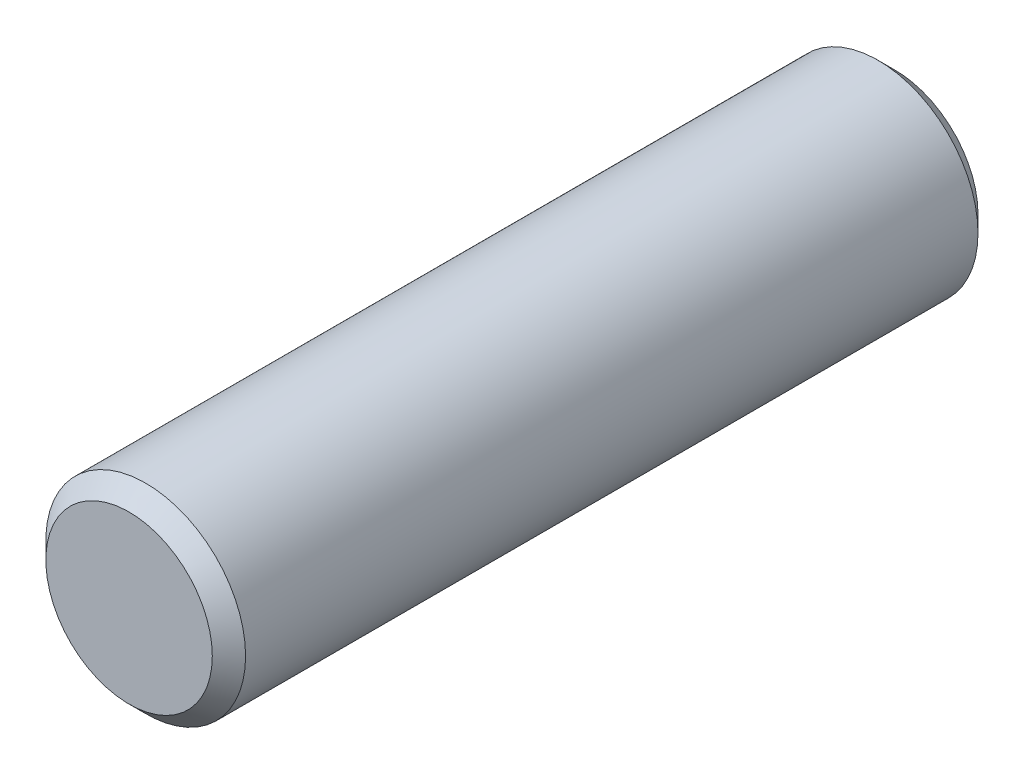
from build123d import *

# Parameters (mm, degrees)
ESQUISSE1_R          = 6
BASE_EXTRUSION_DEPTH = 46
CHANFREIN1_SIZE      = 1


with BuildPart() as part:
    # Esquisse1 → Base-Extrusion (new body)
    with BuildSketch(Plane.XY):
        Circle(ESQUISSE1_R)
    extrude(amount=BASE_EXTRUSION_DEPTH)

    # Chanfrein1
    chanfrein1_edges = [part.edges().sort_by_distance(p)[0] for p in [
        (-6, 0, 0),
        (-6, 0, 46),
    ]]
    chamfer(chanfrein1_edges, length=CHANFREIN1_SIZE)


solid = part.part
